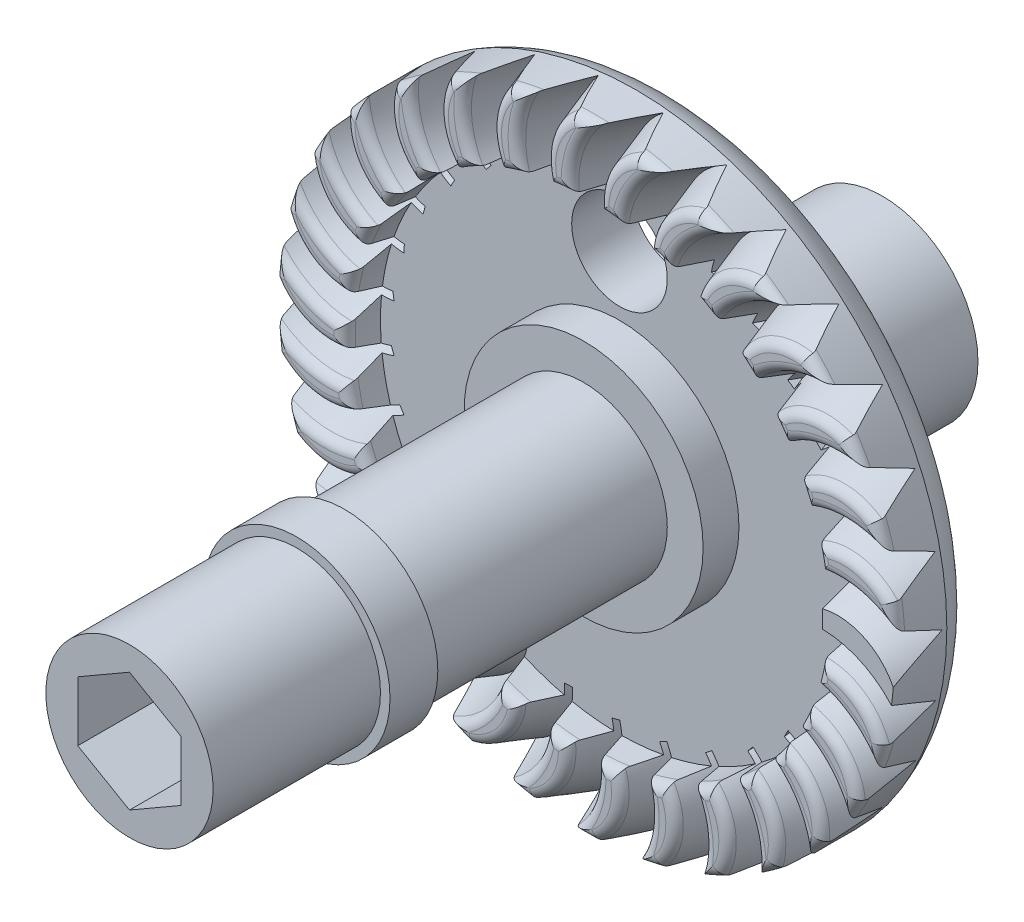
from build123d import *

# Parameters (mm, degrees)
ESQUISSE1_R                  = 4
BASE_EXTRUSION_DEPTH         = 7
ESQUISSE2_R                  = 5
BOSS_EXTRU_1_DEPTH           = 1.5
ESQUISSE3_R                  = 13
BOSS_EXTRU_2_DEPTH           = 4
ENL_V_START                  = -1.5
ESQUISSE4_R                  = 10
ESQUISSE4_R_2                = 5
ENL_V_MAT_EXTRU_1_DEPTH      = 1.5
ESQUISSE5_R                  = 3.5
BOSS_EXTRU_3_DEPTH           = 10
ESQUISSE6_R                  = 3.9
BOSS_EXTRU_4_DEPTH           = 2
ESQUISSE7_R                  = 3.5
BOSS_EXTRU_5_DEPTH           = 7
ENL_V_MAT_EXTRU_2_DEPTH      = 37.47259245
ESQUISSE9_R                  = 2
ENL_V_MAT_EXTRU_3_DEPTH      = 30.444863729
R_P_TITION_CIRCULAIRE1_COUNT = 30
CONG_6_R                     = 0.45


with BuildPart() as part:
    # Esquisse1 → Base-Extrusion (new body)
    with BuildSketch(Plane.XY):
        Circle(ESQUISSE1_R)
    extrude(amount=BASE_EXTRUSION_DEPTH)

    # Esquisse2 → Boss.-Extru.1 (add)
    with BuildSketch(Plane.XY.offset(7)):
        Circle(ESQUISSE2_R)
    extrude(amount=BOSS_EXTRU_1_DEPTH)

    # Esquisse3 → Boss.-Extru.2 (add)
    with BuildSketch(Plane.XY.offset(8.5)):
        Circle(ESQUISSE3_R)
    extrude(amount=BOSS_EXTRU_2_DEPTH)

    # Esquisse4 → Enl_v. mat.-Extru.1 (cut)
    with BuildSketch(Plane.XY.offset(12.5).offset(ENL_V_START)):
        Circle(ESQUISSE4_R)
        Circle(ESQUISSE4_R_2, mode=Mode.SUBTRACT)
    extrude(amount=ENL_V_MAT_EXTRU_1_DEPTH, mode=Mode.SUBTRACT)

    # Esquisse5 → Boss.-Extru.3 (add)
    with BuildSketch(Plane.XY.offset(12.5)):
        Circle(ESQUISSE5_R)
    extrude(amount=BOSS_EXTRU_3_DEPTH)

    # Esquisse6 → Boss.-Extru.4 (add)
    with BuildSketch(Plane.XY.offset(22.5)):
        Circle(ESQUISSE6_R)
    extrude(amount=BOSS_EXTRU_4_DEPTH)

    # Esquisse7 → Boss.-Extru.5 (add)
    with BuildSketch(Plane.XY.offset(24.5)):
        Circle(ESQUISSE7_R)
    extrude(amount=BOSS_EXTRU_5_DEPTH)

    # Esquisse8 → Enl_v. mat.-Extru.2 (cut, through all)
    with BuildSketch(Plane.XY.offset(31.5)):
        Polygon((0, 2.497646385), (2.163025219, 1.248823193), (2.163025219, -1.248823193), (0, -2.497646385), (-2.163025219, -1.248823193), (-2.163025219, 1.248823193), align=None)
    extrude(amount=-ENL_V_MAT_EXTRU_2_DEPTH, mode=Mode.SUBTRACT)

    # Esquisse9 → Enl_v. mat.-Extru.3 (cut, through all)
    with BuildSketch(Plane(origin=(0, 0, 8.5), x_dir=(-1, 0, 0), z_dir=(0, 0, -1))):
        with Locations((0, 7.5)):
            Circle(ESQUISSE9_R)
    extrude(amount=-ENL_V_MAT_EXTRU_3_DEPTH, mode=Mode.SUBTRACT)

    # Enl_vement de mati_re-Balayage2: sweep along a path in Esquisse10
    with BuildLine(Plane.XY.offset(12.5)) as enl_vement_de_mati_re_balayage2_path:
        ThreePointArc((9.837258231, 9.501485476), (7.401485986, 9.383188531), (5.719659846, 7.617277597))
    # Esquisse12 → Enl_vement de mati_re-Balayage2 (sweep, cut)
    with BuildSketch(Plane(origin=(5.719659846, 7.617277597, 12.5), x_dir=(0.9285206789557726, -0.37128068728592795, 0), z_dir=(-0.37128068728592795, -0.9285206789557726, 0))):
        Polygon((0, -2), (-1, 1), (1.017325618, 1), align=None)
    enl_vement_de_mati_re_balayage2 = sweep(path=enl_vement_de_mati_re_balayage2_path.line, mode=Mode.SUBTRACT)

    # R_p_tition circulaire1: Enl_vement de mati_re-Balayage2 ×30 about axis
    r_p_tition_circulaire1_axis = Axis((0, 0, 0), (0, 0, 1))
    for i in range(1, R_P_TITION_CIRCULAIRE1_COUNT):
        add(enl_vement_de_mati_re_balayage2.rotate(r_p_tition_circulaire1_axis, i * 360 / R_P_TITION_CIRCULAIRE1_COUNT), mode=Mode.SUBTRACT)

    # Cong_6
    cong_6_edges = [part.edges().sort_by_distance(p)[0] for p in [
        (12.384414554, 3.953008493, 12.5),
        (9.165954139, 3.998160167, 12.5),
        (11.434206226, 2.561841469, 12.5),
        (10.900702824, 3.971943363, 12.5),
        (12.935662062, 1.291761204, 12.5),
        (9.79692029, 2.005081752, 12.5),
        (11.488309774, 1.618763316, 12.5),
        (11.487661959, -2.310352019, 12.5),
        (12.342721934, -4.081325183, 12.5),
        (9.765472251, -2.153033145, 12.5),
        (10.756279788, -4.648284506, 12.5),
        (11.153503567, -3.193902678, 12.5),
        (11.224448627, -6.558334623, 12.5),
        (9.10443249, -4.136340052, 12.5),
        (9.554796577, -6.783064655, 12.5),
        (10.245723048, -5.443052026, 12.5),
        (9.615613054, -8.748713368, 12.5),
        (8.045485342, -5.938869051, 12.5),
        (7.935722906, -8.621392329, 12.5),
        (8.890155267, -7.454313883, 12.5),
        (7.586529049, -10.556731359, 12.5),
        (6.634911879, -7.481840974, 12.5),
        (5.969820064, -10.082923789, 12.5),
        (7.146045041, -9.139786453, 12.5),
        (5.225877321, -11.903369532, 12.5),
        (4.934360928, -8.697820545, 12.5),
        (3.743007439, -11.103783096, 12.5),
        (5.089618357, -10.425806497, 12.5),
        (2.636829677, -12.729773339, 12.5),
        (3.018154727, -9.533663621, 12.5),
        (1.352607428, -11.6393538, 12.5),
        (2.810750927, -11.256168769, 12.5),
        (-0.067460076, -12.999824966, 12.5),
        (0.970040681, -9.95283985, 12.5),
        (-1.096908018, -11.666228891, 12.5),
        (0.409040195, -11.594582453, 12.5),
        (-2.768801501, -12.701721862, 12.5),
        (-1.120468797, -9.937029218, 12.5),
        (-3.49848332, -11.183233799, 12.5),
        (-2.010547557, -11.426257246, 12.5),
        (-5.349133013, -11.848492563, 12.5),
        (-3.162008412, -9.486922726, 12.5),
        (-5.747158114, -10.211477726, 12.5),
        (-4.342264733, -10.758549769, 12.5),
        (-7.695681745, -10.477427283, 12.5),
        (-5.065353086, -8.622192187, 12.5),
        (-7.74465452, -8.793431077, 12.5),
        (-6.484204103, -9.620642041, 12.5),
        (-9.705892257, -8.648448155, 12.5),
        (-6.747317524, -7.380630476, 12.5),
        (-9.40367236, -6.991069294, 12.5),
        (-8.34275264, -8.062266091, 12.5),
        (-11.291908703, -6.441490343, 12.5),
        (-8.134391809, -5.816499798, 12.5),
        (-10.651704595, -4.883164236, 12.5),
        (-9.836682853, -6.151530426, 12.5),
        (-12.384414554, -3.953008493, 12.5),
        (-9.165954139, -3.998160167, 12.5),
        (-11.434206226, -2.561841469, 12.5),
        (-10.900702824, -3.971943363, 12.5),
        (-12.935662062, -1.291761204, 12.5),
        (-9.79692029, -2.005081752, 12.5),
        (-11.716978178, -0.128553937, 12.5),
        (-11.488309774, -1.618763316, 12.5),
        (-12.921559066, 1.425942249, 12.5),
        (-9.999714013, 0.075628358, 12.5),
        (-11.487661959, 2.310352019, 12.5),
        (-11.57382246, 0.805164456, 12.5),
        (-12.342721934, 4.081325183, 12.5),
        (-9.765472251, 2.153033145, 12.5),
        (-10.756279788, 4.648284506, 12.5),
        (-11.153503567, 3.193902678, 12.5),
        (-11.224448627, 6.558334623, 12.5),
        (-9.10443249, 4.136340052, 12.5),
        (-9.554796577, 6.783064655, 12.5),
        (-10.245723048, 5.443052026, 12.5),
        (-9.615613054, 8.748713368, 12.5),
        (-8.045485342, 5.938869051, 12.5),
        (-7.935722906, 8.621392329, 12.5),
        (-8.890155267, 7.454313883, 12.5),
        (-7.586529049, 10.556731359, 12.5),
        (-6.634911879, 7.481840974, 12.5),
        (-5.969820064, 10.082923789, 12.5),
        (-7.146045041, 9.139786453, 12.5),
        (-5.225877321, 11.903369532, 12.5),
        (-4.934360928, 8.697820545, 12.5),
        (-3.743007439, 11.103783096, 12.5),
        (-5.089618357, 10.425806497, 12.5),
        (-2.636829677, 12.729773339, 12.5),
        (-3.018154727, 9.533663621, 12.5),
        (-1.352607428, 11.6393538, 12.5),
        (-2.810750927, 11.256168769, 12.5),
        (0.067460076, 12.999824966, 12.5),
        (-0.970040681, 9.95283985, 12.5),
        (1.096908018, 11.666228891, 12.5),
        (-0.409040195, 11.594582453, 12.5),
        (2.768801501, 12.701721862, 12.5),
        (1.120468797, 9.937029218, 12.5),
        (3.49848332, 11.183233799, 12.5),
        (2.010547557, 11.426257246, 12.5),
        (5.349133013, 11.848492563, 12.5),
        (3.162008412, 9.486922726, 12.5),
        (5.747158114, 10.211477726, 12.5),
        (4.342264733, 10.758549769, 12.5),
        (5.065353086, 8.622192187, 12.5),
        (7.695681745, 10.477427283, 12.5),
        (7.74465452, 8.793431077, 12.5),
        (6.484204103, 9.620642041, 12.5),
        (6.747317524, 7.380630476, 12.5),
        (9.705892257, 8.648448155, 12.5),
        (9.40367236, 6.991069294, 12.5),
        (8.34275264, 8.062266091, 12.5),
        (11.291908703, 6.441490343, 12.5),
        (8.134391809, 5.816499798, 12.5),
        (10.651704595, 4.883164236, 12.5),
        (9.836682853, 6.151530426, 12.5),
    ]]
    fillet(cong_6_edges, radius=CONG_6_R)

    # Esquisse13 → Enl_vement de mati_re-R_volution1 (revolve, cut)
    with BuildSketch(Plane(origin=(0, 0, 0), x_dir=(1, 0, 0), z_dir=(0, 1, 0))):
        with BuildLine():
            Line((-10.55866773, -8.5), (-10.611807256, -7.755740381))
            Line((-10.611807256, -7.755740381), (-13.589731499, -7.755740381))
            Line((-13.589731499, -7.755740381), (-13.450212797, -10.303913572))
            Line((-13.450212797, -10.303913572), (-13, -10.303913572))
            ThreePointArc((-13, -10.303913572), (-12.076413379, -8.999903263), (-10.55866773, -8.5))
        make_face()
    revolve(axis=Axis((0, 0, 1.837822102), (0, 0, 1)), mode=Mode.SUBTRACT)


solid = part.part
